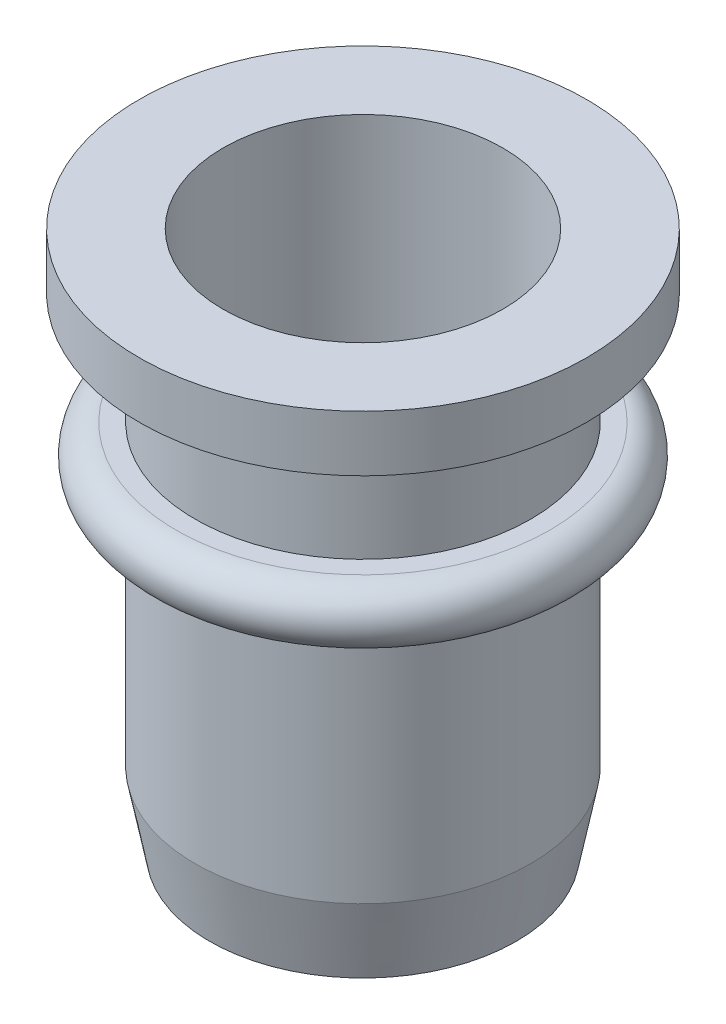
ISO-10303-21;
HEADER;
FILE_DESCRIPTION(('STEP AP214'),'2;1');
FILE_NAME('part.step','',(''),(''),'','','');
FILE_SCHEMA(('AUTOMOTIVE_DESIGN { 1 0 10303 214 1 1 1 1 }'));
ENDSEC;
DATA;
#1=APPLICATION_CONTEXT('core data for automotive mechanical design processes');
#2=APPLICATION_PROTOCOL_DEFINITION('international standard','automotive_design',2000,#1);
#3=PRODUCT_CONTEXT('',#1,'mechanical');
#4=PRODUCT('Part','Part','',(#3));
#5=PRODUCT_RELATED_PRODUCT_CATEGORY('part','',(#4));
#6=PRODUCT_DEFINITION_FORMATION('','',#4);
#7=PRODUCT_DEFINITION_CONTEXT('part definition',#1,'design');
#8=PRODUCT_DEFINITION('design','',#6,#7);
#9=PRODUCT_DEFINITION_SHAPE('','',#8);
#10=(LENGTH_UNIT() NAMED_UNIT(*) SI_UNIT(.MILLI.,.METRE.));
#11=(NAMED_UNIT(*) PLANE_ANGLE_UNIT() SI_UNIT($,.RADIAN.));
#12=(NAMED_UNIT(*) SI_UNIT($,.STERADIAN.) SOLID_ANGLE_UNIT());
#13=UNCERTAINTY_MEASURE_WITH_UNIT(LENGTH_MEASURE(1.E-05),#10,'distance_accuracy_value','');
#14=(GEOMETRIC_REPRESENTATION_CONTEXT(3) GLOBAL_UNCERTAINTY_ASSIGNED_CONTEXT((#13)) GLOBAL_UNIT_ASSIGNED_CONTEXT((#10,
#11,#12)) REPRESENTATION_CONTEXT('',''));
#15=CARTESIAN_POINT('',(0.,0.,0.));
#16=DIRECTION('',(0.,0.,1.));
#17=DIRECTION('',(1.,0.,0.));
#18=AXIS2_PLACEMENT_3D('',#15,#16,#17);
#19=CARTESIAN_POINT('',(0.,8.28,0.));
#20=DIRECTION('',(0.,1.,0.));
#21=DIRECTION('',(1.,0.,0.));
#22=AXIS2_PLACEMENT_3D('',#19,#20,#21);
#23=CONICAL_SURFACE('',#22,2.78,0.785398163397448);
#24=CARTESIAN_POINT('',(0.,8.06,0.));
#25=DIRECTION('',(0.,-1.,0.));
#26=DIRECTION('',(1.,0.,0.));
#27=AXIS2_PLACEMENT_3D('',#24,#25,#26);
#28=CIRCLE('',#27,2.56);
#29=CARTESIAN_POINT('',(2.56,8.06,0.));
#30=VERTEX_POINT('',#29);
#31=EDGE_CURVE('E10',#30,#30,#28,.T.);
#32=ORIENTED_EDGE('',*,*,#31,.T.);
#33=EDGE_LOOP('',(#32));
#34=FACE_BOUND('',#33,.T.);
#35=CARTESIAN_POINT('',(0.,8.5,0.));
#36=DIRECTION('',(0.,-1.,0.));
#37=DIRECTION('',(1.,0.,0.));
#38=AXIS2_PLACEMENT_3D('',#35,#36,#37);
#39=CIRCLE('',#38,3.);
#40=CARTESIAN_POINT('',(3.,8.5,0.));
#41=VERTEX_POINT('',#40);
#42=EDGE_CURVE('E106',#41,#41,#39,.T.);
#43=ORIENTED_EDGE('',*,*,#42,.F.);
#44=EDGE_LOOP('',(#43));
#45=FACE_BOUND('',#44,.T.);
#46=ADVANCED_FACE('F15',(#34,#45),#23,.F.);
#47=CARTESIAN_POINT('',(0.,4.25,0.));
#48=DIRECTION('',(0.,1.,0.));
#49=DIRECTION('',(1.,0.,0.));
#50=AXIS2_PLACEMENT_3D('',#47,#48,#49);
#51=CYLINDRICAL_SURFACE('',#50,2.56);
#52=CARTESIAN_POINT('',(0.,0.44,0.));
#53=DIRECTION('',(0.,-1.,0.));
#54=DIRECTION('',(1.,0.,0.));
#55=AXIS2_PLACEMENT_3D('',#52,#53,#54);
#56=CIRCLE('',#55,2.56);
#57=CARTESIAN_POINT('',(2.56,0.44,0.));
#58=VERTEX_POINT('',#57);
#59=EDGE_CURVE('E25',#58,#58,#56,.T.);
#60=ORIENTED_EDGE('',*,*,#59,.T.);
#61=EDGE_LOOP('',(#60));
#62=FACE_BOUND('',#61,.T.);
#63=ORIENTED_EDGE('',*,*,#31,.F.);
#64=EDGE_LOOP('',(#63));
#65=FACE_BOUND('',#64,.T.);
#66=ADVANCED_FACE('F138',(#62,#65),#51,.F.);
#67=CARTESIAN_POINT('',(0.,0.22,0.));
#68=DIRECTION('',(0.,-1.,0.));
#69=DIRECTION('',(1.,0.,0.));
#70=AXIS2_PLACEMENT_3D('',#67,#68,#69);
#71=CONICAL_SURFACE('',#70,2.78,0.785398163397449);
#72=CARTESIAN_POINT('',(0.,0.,0.));
#73=DIRECTION('',(0.,1.,0.));
#74=DIRECTION('',(1.,0.,0.));
#75=AXIS2_PLACEMENT_3D('',#72,#73,#74);
#76=CIRCLE('',#75,3.);
#77=CARTESIAN_POINT('',(3.,0.,0.));
#78=VERTEX_POINT('',#77);
#79=EDGE_CURVE('E87',#78,#78,#76,.T.);
#80=ORIENTED_EDGE('',*,*,#79,.F.);
#81=EDGE_LOOP('',(#80));
#82=FACE_BOUND('',#81,.T.);
#83=ORIENTED_EDGE('',*,*,#59,.F.);
#84=EDGE_LOOP('',(#83));
#85=FACE_BOUND('',#84,.T.);
#86=ADVANCED_FACE('F124',(#82,#85),#71,.F.);
#87=CARTESIAN_POINT('',(0.,12.75,0.));
#88=DIRECTION('',(0.,1.,0.));
#89=DIRECTION('',(1.,0.,0.));
#90=AXIS2_PLACEMENT_3D('',#87,#88,#89);
#91=CYLINDRICAL_SURFACE('',#90,3.75);
#92=CARTESIAN_POINT('',(0.,14.5,0.));
#93=DIRECTION('',(0.,-1.,0.));
#94=DIRECTION('',(1.,0.,0.));
#95=AXIS2_PLACEMENT_3D('',#92,#93,#94);
#96=CIRCLE('',#95,3.75);
#97=CARTESIAN_POINT('',(-3.75,14.5,0.));
#98=VERTEX_POINT('',#97);
#99=EDGE_CURVE('E19',#98,#98,#96,.T.);
#100=ORIENTED_EDGE('',*,*,#99,.F.);
#101=EDGE_LOOP('',(#100));
#102=FACE_BOUND('',#101,.T.);
#103=CARTESIAN_POINT('',(0.,8.5,0.));
#104=DIRECTION('',(0.,-1.,0.));
#105=DIRECTION('',(1.,0.,0.));
#106=AXIS2_PLACEMENT_3D('',#103,#104,#105);
#107=CIRCLE('',#106,3.75);
#108=CARTESIAN_POINT('',(3.75,8.5,0.));
#109=VERTEX_POINT('',#108);
#110=EDGE_CURVE('E103',#109,#109,#107,.T.);
#111=ORIENTED_EDGE('',*,*,#110,.T.);
#112=EDGE_LOOP('',(#111));
#113=FACE_BOUND('',#112,.T.);
#114=ADVANCED_FACE('F120',(#102,#113),#91,.F.);
#115=CARTESIAN_POINT('',(0.,8.5,0.));
#116=DIRECTION('',(0.,-1.,0.));
#117=DIRECTION('',(1.,0.,0.));
#118=AXIS2_PLACEMENT_3D('',#115,#116,#117);
#119=PLANE('',#118);
#120=ORIENTED_EDGE('',*,*,#42,.T.);
#121=EDGE_LOOP('',(#120));
#122=FACE_BOUND('',#121,.T.);
#123=ORIENTED_EDGE('',*,*,#110,.F.);
#124=EDGE_LOOP('',(#123));
#125=FACE_BOUND('',#124,.T.);
#126=ADVANCED_FACE('F123',(#122,#125),#119,.F.);
#127=CARTESIAN_POINT('',(2.505,10.,0.));
#128=DIRECTION('',(0.,1.,0.));
#129=DIRECTION('',(1.,0.,0.));
#130=AXIS2_PLACEMENT_3D('',#127,#128,#129);
#131=PLANE('',#130);
#132=CARTESIAN_POINT('',(0.,10.,0.));
#133=DIRECTION('',(0.,1.,0.));
#134=DIRECTION('',(1.,0.,0.));
#135=AXIS2_PLACEMENT_3D('',#132,#133,#134);
#136=CIRCLE('',#135,5.01);
#137=CARTESIAN_POINT('',(5.01,10.,0.));
#138=VERTEX_POINT('',#137);
#139=EDGE_CURVE('E108',#138,#138,#136,.T.);
#140=ORIENTED_EDGE('',*,*,#139,.T.);
#141=EDGE_LOOP('',(#140));
#142=FACE_BOUND('',#141,.T.);
#143=CARTESIAN_POINT('',(0.,10.,0.));
#144=DIRECTION('',(0.,1.,0.));
#145=DIRECTION('',(1.,0.,0.));
#146=AXIS2_PLACEMENT_3D('',#143,#144,#145);
#147=CIRCLE('',#146,4.5);
#148=CARTESIAN_POINT('',(-4.5,10.,0.));
#149=VERTEX_POINT('',#148);
#150=EDGE_CURVE('E93',#149,#149,#147,.T.);
#151=ORIENTED_EDGE('',*,*,#150,.F.);
#152=EDGE_LOOP('',(#151));
#153=FACE_BOUND('',#152,.T.);
#154=ADVANCED_FACE('F128',(#142,#153),#131,.T.);
#155=CARTESIAN_POINT('',(0.,7.96,0.));
#156=DIRECTION('',(0.,1.,0.));
#157=DIRECTION('',(0.,0.,1.));
#158=AXIS2_PLACEMENT_3D('',#155,#156,#157);
#159=TOROIDAL_SURFACE('',#158,5.01,0.51);
#160=CARTESIAN_POINT('',(0.,8.47,0.));
#161=DIRECTION('',(0.,1.,0.));
#162=DIRECTION('',(1.,0.,0.));
#163=AXIS2_PLACEMENT_3D('',#160,#161,#162);
#164=CIRCLE('',#163,5.01);
#165=CARTESIAN_POINT('',(5.01,8.47,0.));
#166=VERTEX_POINT('',#165);
#167=EDGE_CURVE('E96',#166,#166,#164,.T.);
#168=ORIENTED_EDGE('',*,*,#167,.F.);
#169=EDGE_LOOP('',(#168));
#170=FACE_BOUND('',#169,.T.);
#171=CARTESIAN_POINT('',(0.,7.96,0.));
#172=DIRECTION('',(0.,1.,0.));
#173=DIRECTION('',(1.,0.,0.));
#174=AXIS2_PLACEMENT_3D('',#171,#172,#173);
#175=CIRCLE('',#174,4.5);
#176=CARTESIAN_POINT('',(4.5,7.96,0.));
#177=VERTEX_POINT('',#176);
#178=EDGE_CURVE('E76',#177,#177,#175,.T.);
#179=ORIENTED_EDGE('',*,*,#178,.T.);
#180=EDGE_LOOP('',(#179));
#181=FACE_BOUND('',#180,.T.);
#182=ADVANCED_FACE('F17',(#170,#181),#159,.F.);
#183=CARTESIAN_POINT('',(0.,9.235,0.));
#184=DIRECTION('',(0.,1.,0.));
#185=DIRECTION('',(0.,0.,1.));
#186=AXIS2_PLACEMENT_3D('',#183,#184,#185);
#187=TOROIDAL_SURFACE('',#186,5.01,0.765);
#188=ORIENTED_EDGE('',*,*,#139,.F.);
#189=EDGE_LOOP('',(#188));
#190=FACE_BOUND('',#189,.T.);
#191=ORIENTED_EDGE('',*,*,#167,.T.);
#192=EDGE_LOOP('',(#191));
#193=FACE_BOUND('',#192,.T.);
#194=ADVANCED_FACE('F166',(#190,#193),#187,.T.);
#195=CARTESIAN_POINT('',(0.,7.5,0.));
#196=DIRECTION('',(0.,-1.,0.));
#197=DIRECTION('',(1.,0.,0.));
#198=AXIS2_PLACEMENT_3D('',#195,#196,#197);
#199=CYLINDRICAL_SURFACE('',#198,4.5);
#200=CARTESIAN_POINT('',(0.,13.,0.));
#201=DIRECTION('',(0.,1.,0.));
#202=DIRECTION('',(1.,0.,0.));
#203=AXIS2_PLACEMENT_3D('',#200,#201,#202);
#204=CIRCLE('',#203,4.5);
#205=CARTESIAN_POINT('',(4.5,13.,0.));
#206=VERTEX_POINT('',#205);
#207=EDGE_CURVE('E80',#206,#206,#204,.T.);
#208=ORIENTED_EDGE('',*,*,#207,.F.);
#209=EDGE_LOOP('',(#208));
#210=FACE_BOUND('',#209,.T.);
#211=ORIENTED_EDGE('',*,*,#150,.T.);
#212=EDGE_LOOP('',(#211));
#213=FACE_BOUND('',#212,.T.);
#214=ADVANCED_FACE('F81',(#210,#213),#199,.T.);
#215=CARTESIAN_POINT('',(0.,7.5,0.));
#216=DIRECTION('',(0.,-1.,0.));
#217=DIRECTION('',(1.,0.,0.));
#218=AXIS2_PLACEMENT_3D('',#215,#216,#217);
#219=CYLINDRICAL_SURFACE('',#218,4.5);
#220=CARTESIAN_POINT('',(0.,2.,0.));
#221=DIRECTION('',(0.,1.,0.));
#222=DIRECTION('',(1.,0.,0.));
#223=AXIS2_PLACEMENT_3D('',#220,#221,#222);
#224=CIRCLE('',#223,4.5);
#225=CARTESIAN_POINT('',(4.5,2.,0.));
#226=VERTEX_POINT('',#225);
#227=EDGE_CURVE('E97',#226,#226,#224,.T.);
#228=ORIENTED_EDGE('',*,*,#227,.T.);
#229=EDGE_LOOP('',(#228));
#230=FACE_BOUND('',#229,.T.);
#231=ORIENTED_EDGE('',*,*,#178,.F.);
#232=EDGE_LOOP('',(#231));
#233=FACE_BOUND('',#232,.T.);
#234=ADVANCED_FACE('F148',(#230,#233),#219,.T.);
#235=CARTESIAN_POINT('',(2.05561969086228,0.,0.));
#236=DIRECTION('',(0.,-1.,0.));
#237=DIRECTION('',(-1.,0.,0.));
#238=AXIS2_PLACEMENT_3D('',#235,#236,#237);
#239=PLANE('',#238);
#240=ORIENTED_EDGE('',*,*,#79,.T.);
#241=EDGE_LOOP('',(#240));
#242=FACE_BOUND('',#241,.T.);
#243=CARTESIAN_POINT('',(0.,0.,0.));
#244=DIRECTION('',(0.,1.,0.));
#245=DIRECTION('',(1.,0.,0.));
#246=AXIS2_PLACEMENT_3D('',#243,#244,#245);
#247=CIRCLE('',#246,4.11123938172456);
#248=CARTESIAN_POINT('',(4.11123938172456,0.,0.));
#249=VERTEX_POINT('',#248);
#250=EDGE_CURVE('E84',#249,#249,#247,.T.);
#251=ORIENTED_EDGE('',*,*,#250,.F.);
#252=EDGE_LOOP('',(#251));
#253=FACE_BOUND('',#252,.T.);
#254=ADVANCED_FACE('F170',(#242,#253),#239,.T.);
#255=CARTESIAN_POINT('',(0.,1.,0.));
#256=DIRECTION('',(0.,1.,0.));
#257=DIRECTION('',(1.,0.,0.));
#258=AXIS2_PLACEMENT_3D('',#255,#256,#257);
#259=CONICAL_SURFACE('',#258,4.30561969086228,0.191986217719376);
#260=ORIENTED_EDGE('',*,*,#227,.F.);
#261=EDGE_LOOP('',(#260));
#262=FACE_BOUND('',#261,.T.);
#263=ORIENTED_EDGE('',*,*,#250,.T.);
#264=EDGE_LOOP('',(#263));
#265=FACE_BOUND('',#264,.T.);
#266=ADVANCED_FACE('F159',(#262,#265),#259,.T.);
#267=CARTESIAN_POINT('',(5.25,13.,0.));
#268=DIRECTION('',(0.,-1.,0.));
#269=DIRECTION('',(-1.,0.,0.));
#270=AXIS2_PLACEMENT_3D('',#267,#268,#269);
#271=PLANE('',#270);
#272=CARTESIAN_POINT('',(0.,13.,0.));
#273=DIRECTION('',(0.,1.,0.));
#274=DIRECTION('',(1.,0.,0.));
#275=AXIS2_PLACEMENT_3D('',#272,#273,#274);
#276=CIRCLE('',#275,6.);
#277=CARTESIAN_POINT('',(6.,13.,0.));
#278=VERTEX_POINT('',#277);
#279=EDGE_CURVE('E66',#278,#278,#276,.T.);
#280=ORIENTED_EDGE('',*,*,#279,.F.);
#281=EDGE_LOOP('',(#280));
#282=FACE_BOUND('',#281,.T.);
#283=ORIENTED_EDGE('',*,*,#207,.T.);
#284=EDGE_LOOP('',(#283));
#285=FACE_BOUND('',#284,.T.);
#286=ADVANCED_FACE('F155',(#282,#285),#271,.T.);
#287=CARTESIAN_POINT('',(0.,13.75,0.));
#288=DIRECTION('',(0.,-1.,0.));
#289=DIRECTION('',(1.,0.,0.));
#290=AXIS2_PLACEMENT_3D('',#287,#288,#289);
#291=CYLINDRICAL_SURFACE('',#290,6.);
#292=CARTESIAN_POINT('',(0.,14.5,0.));
#293=DIRECTION('',(0.,1.,0.));
#294=DIRECTION('',(1.,0.,0.));
#295=AXIS2_PLACEMENT_3D('',#292,#293,#294);
#296=CIRCLE('',#295,6.);
#297=CARTESIAN_POINT('',(6.,14.5,0.));
#298=VERTEX_POINT('',#297);
#299=EDGE_CURVE('E61',#298,#298,#296,.T.);
#300=ORIENTED_EDGE('',*,*,#299,.F.);
#301=EDGE_LOOP('',(#300));
#302=FACE_BOUND('',#301,.T.);
#303=ORIENTED_EDGE('',*,*,#279,.T.);
#304=EDGE_LOOP('',(#303));
#305=FACE_BOUND('',#304,.T.);
#306=ADVANCED_FACE('F151',(#302,#305),#291,.T.);
#307=CARTESIAN_POINT('',(3.,14.5,0.));
#308=DIRECTION('',(0.,1.,0.));
#309=DIRECTION('',(1.,0.,0.));
#310=AXIS2_PLACEMENT_3D('',#307,#308,#309);
#311=PLANE('',#310);
#312=ORIENTED_EDGE('',*,*,#99,.T.);
#313=EDGE_LOOP('',(#312));
#314=FACE_BOUND('',#313,.T.);
#315=ORIENTED_EDGE('',*,*,#299,.T.);
#316=EDGE_LOOP('',(#315));
#317=FACE_BOUND('',#316,.T.);
#318=ADVANCED_FACE('F118',(#314,#317),#311,.T.);
#319=CLOSED_SHELL('',(#46,#66,#86,#114,#126,#154,#182,#194,#214,#234,#254,#266,#286,#306,#318));
#320=MANIFOLD_SOLID_BREP('B1',#319);
#321=ADVANCED_BREP_SHAPE_REPRESENTATION('',(#18,#320),#14);
#322=SHAPE_DEFINITION_REPRESENTATION(#9,#321);
ENDSEC;
END-ISO-10303-21;
